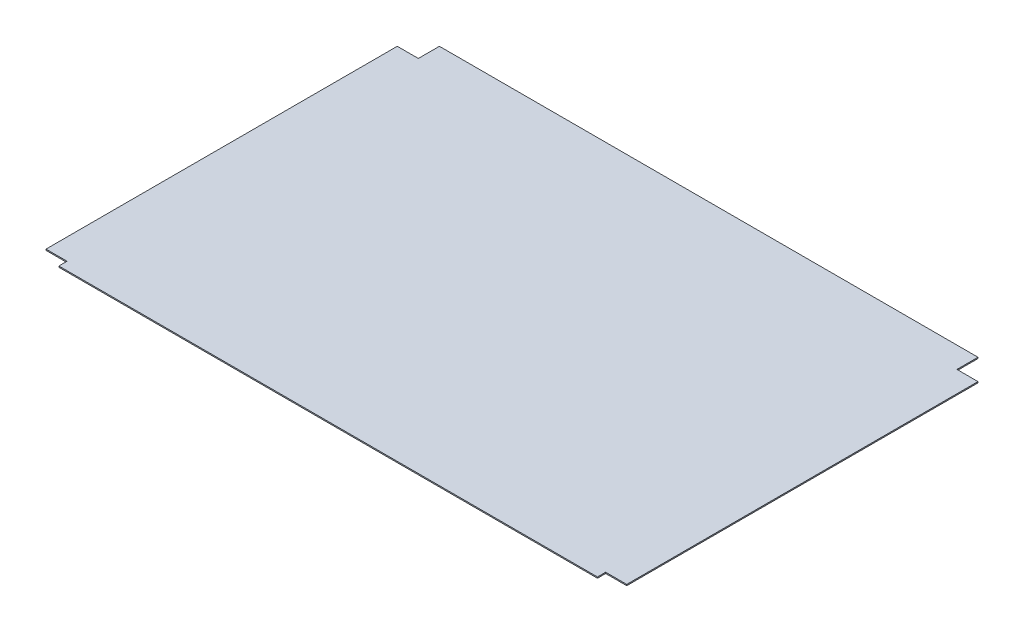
ISO-10303-21;
HEADER;
FILE_DESCRIPTION(('STEP AP214'),'2;1');
FILE_NAME('part.step','',(''),(''),'','','');
FILE_SCHEMA(('AUTOMOTIVE_DESIGN { 1 0 10303 214 1 1 1 1 }'));
ENDSEC;
DATA;
#1=APPLICATION_CONTEXT('core data for automotive mechanical design processes');
#2=APPLICATION_PROTOCOL_DEFINITION('international standard','automotive_design',2000,#1);
#3=PRODUCT_CONTEXT('',#1,'mechanical');
#4=PRODUCT('Part','Part','',(#3));
#5=PRODUCT_RELATED_PRODUCT_CATEGORY('part','',(#4));
#6=PRODUCT_DEFINITION_FORMATION('','',#4);
#7=PRODUCT_DEFINITION_CONTEXT('part definition',#1,'design');
#8=PRODUCT_DEFINITION('design','',#6,#7);
#9=PRODUCT_DEFINITION_SHAPE('','',#8);
#10=(LENGTH_UNIT() NAMED_UNIT(*) SI_UNIT(.MILLI.,.METRE.));
#11=(NAMED_UNIT(*) PLANE_ANGLE_UNIT() SI_UNIT($,.RADIAN.));
#12=(NAMED_UNIT(*) SI_UNIT($,.STERADIAN.) SOLID_ANGLE_UNIT());
#13=UNCERTAINTY_MEASURE_WITH_UNIT(LENGTH_MEASURE(1.E-05),#10,'distance_accuracy_value','');
#14=(GEOMETRIC_REPRESENTATION_CONTEXT(3) GLOBAL_UNCERTAINTY_ASSIGNED_CONTEXT((#13)) GLOBAL_UNIT_ASSIGNED_CONTEXT((#10,
#11,#12)) REPRESENTATION_CONTEXT('',''));
#15=CARTESIAN_POINT('',(0.,0.,0.));
#16=DIRECTION('',(0.,0.,1.));
#17=DIRECTION('',(1.,0.,0.));
#18=AXIS2_PLACEMENT_3D('',#15,#16,#17);
#19=CARTESIAN_POINT('',(-314.96,1.27,-213.36));
#20=DIRECTION('',(0.,1.,0.));
#21=DIRECTION('',(0.,0.,1.));
#22=AXIS2_PLACEMENT_3D('',#19,#20,#21);
#23=PLANE('',#22);
#24=DIRECTION('',(0.,0.,-1.));
#25=VECTOR('',#24,1.);
#26=CARTESIAN_POINT('',(-292.1,1.27,213.36));
#27=LINE('',#26,#25);
#28=CARTESIAN_POINT('',(-292.1,1.27,199.39));
#29=VERTEX_POINT('',#28);
#30=CARTESIAN_POINT('',(-292.1,1.27,190.5));
#31=VERTEX_POINT('',#30);
#32=EDGE_CURVE('E137',#29,#31,#27,.T.);
#33=ORIENTED_EDGE('',*,*,#32,.F.);
#34=DIRECTION('',(-1.,0.,0.));
#35=VECTOR('',#34,1.);
#36=CARTESIAN_POINT('',(292.1,1.27,199.39));
#37=LINE('',#36,#35);
#38=CARTESIAN_POINT('',(292.1,1.27,199.39));
#39=VERTEX_POINT('',#38);
#40=EDGE_CURVE('E125',#39,#29,#37,.T.);
#41=ORIENTED_EDGE('',*,*,#40,.F.);
#42=DIRECTION('',(0.,0.,-1.));
#43=VECTOR('',#42,1.);
#44=CARTESIAN_POINT('',(292.1,1.27,213.36));
#45=LINE('',#44,#43);
#46=CARTESIAN_POINT('',(292.1,1.27,190.5));
#47=VERTEX_POINT('',#46);
#48=EDGE_CURVE('E134',#39,#47,#45,.T.);
#49=ORIENTED_EDGE('',*,*,#48,.T.);
#50=DIRECTION('',(1.,0.,0.));
#51=VECTOR('',#50,1.);
#52=CARTESIAN_POINT('',(314.96,1.27,190.5));
#53=LINE('',#52,#51);
#54=CARTESIAN_POINT('',(314.96,1.27,190.5));
#55=VERTEX_POINT('',#54);
#56=EDGE_CURVE('E145',#47,#55,#53,.T.);
#57=ORIENTED_EDGE('',*,*,#56,.T.);
#58=DIRECTION('',(0.,0.,-1.));
#59=VECTOR('',#58,1.);
#60=CARTESIAN_POINT('',(314.96,1.27,213.36));
#61=LINE('',#60,#59);
#62=CARTESIAN_POINT('',(314.96,1.27,-190.5));
#63=VERTEX_POINT('',#62);
#64=EDGE_CURVE('E43',#55,#63,#61,.T.);
#65=ORIENTED_EDGE('',*,*,#64,.T.);
#66=DIRECTION('',(1.,0.,0.));
#67=VECTOR('',#66,1.);
#68=CARTESIAN_POINT('',(314.96,1.27,-190.5));
#69=LINE('',#68,#67);
#70=CARTESIAN_POINT('',(292.1,1.27,-190.5));
#71=VERTEX_POINT('',#70);
#72=EDGE_CURVE('E217',#71,#63,#69,.T.);
#73=ORIENTED_EDGE('',*,*,#72,.F.);
#74=DIRECTION('',(0.,0.,1.));
#75=VECTOR('',#74,1.);
#76=CARTESIAN_POINT('',(292.1,1.27,-213.36));
#77=LINE('',#76,#75);
#78=CARTESIAN_POINT('',(292.1,1.27,-213.36));
#79=VERTEX_POINT('',#78);
#80=EDGE_CURVE('E213',#79,#71,#77,.T.);
#81=ORIENTED_EDGE('',*,*,#80,.F.);
#82=DIRECTION('',(-1.,0.,0.));
#83=VECTOR('',#82,1.);
#84=CARTESIAN_POINT('',(314.96,1.27,-213.36));
#85=LINE('',#84,#83);
#86=CARTESIAN_POINT('',(-292.1,1.27,-213.36));
#87=VERTEX_POINT('',#86);
#88=EDGE_CURVE('E11',#79,#87,#85,.T.);
#89=ORIENTED_EDGE('',*,*,#88,.T.);
#90=DIRECTION('',(0.,0.,1.));
#91=VECTOR('',#90,1.);
#92=CARTESIAN_POINT('',(-292.1,1.27,-213.36));
#93=LINE('',#92,#91);
#94=CARTESIAN_POINT('',(-292.1,1.27,-190.5));
#95=VERTEX_POINT('',#94);
#96=EDGE_CURVE('E59',#87,#95,#93,.T.);
#97=ORIENTED_EDGE('',*,*,#96,.T.);
#98=DIRECTION('',(-1.,0.,0.));
#99=VECTOR('',#98,1.);
#100=CARTESIAN_POINT('',(-314.96,1.27,-190.5));
#101=LINE('',#100,#99);
#102=CARTESIAN_POINT('',(-314.96,1.27,-190.5));
#103=VERTEX_POINT('',#102);
#104=EDGE_CURVE('E208',#95,#103,#101,.T.);
#105=ORIENTED_EDGE('',*,*,#104,.T.);
#106=DIRECTION('',(0.,0.,1.));
#107=VECTOR('',#106,1.);
#108=CARTESIAN_POINT('',(-314.96,1.27,213.36));
#109=LINE('',#108,#107);
#110=CARTESIAN_POINT('',(-314.96,1.27,190.5));
#111=VERTEX_POINT('',#110);
#112=EDGE_CURVE('E172',#103,#111,#109,.T.);
#113=ORIENTED_EDGE('',*,*,#112,.T.);
#114=DIRECTION('',(-1.,0.,0.));
#115=VECTOR('',#114,1.);
#116=CARTESIAN_POINT('',(-314.96,1.27,190.5));
#117=LINE('',#116,#115);
#118=EDGE_CURVE('E159',#31,#111,#117,.T.);
#119=ORIENTED_EDGE('',*,*,#118,.F.);
#120=EDGE_LOOP('',(#33,#41,#49,#57,#65,#73,#81,#89,#97,#105,#113,#119));
#121=FACE_BOUND('',#120,.T.);
#122=ADVANCED_FACE('F34',(#121),#23,.T.);
#123=CARTESIAN_POINT('',(-314.96,0.,-213.36));
#124=DIRECTION('',(0.,1.,0.));
#125=DIRECTION('',(0.,0.,1.));
#126=AXIS2_PLACEMENT_3D('',#123,#124,#125);
#127=PLANE('',#126);
#128=DIRECTION('',(1.,0.,0.));
#129=VECTOR('',#128,1.);
#130=CARTESIAN_POINT('',(-292.1,0.,199.39));
#131=LINE('',#130,#129);
#132=CARTESIAN_POINT('',(-292.1,0.,199.39));
#133=VERTEX_POINT('',#132);
#134=CARTESIAN_POINT('',(292.1,0.,199.39));
#135=VERTEX_POINT('',#134);
#136=EDGE_CURVE('E51',#133,#135,#131,.T.);
#137=ORIENTED_EDGE('',*,*,#136,.F.);
#138=DIRECTION('',(0.,0.,-1.));
#139=VECTOR('',#138,1.);
#140=CARTESIAN_POINT('',(-292.1,0.,213.36));
#141=LINE('',#140,#139);
#142=CARTESIAN_POINT('',(-292.1,0.,190.5));
#143=VERTEX_POINT('',#142);
#144=EDGE_CURVE('E156',#133,#143,#141,.T.);
#145=ORIENTED_EDGE('',*,*,#144,.T.);
#146=DIRECTION('',(-1.,0.,0.));
#147=VECTOR('',#146,1.);
#148=CARTESIAN_POINT('',(-314.96,0.,190.5));
#149=LINE('',#148,#147);
#150=CARTESIAN_POINT('',(-314.96,0.,190.5));
#151=VERTEX_POINT('',#150);
#152=EDGE_CURVE('E158',#143,#151,#149,.T.);
#153=ORIENTED_EDGE('',*,*,#152,.T.);
#154=DIRECTION('',(0.,0.,1.));
#155=VECTOR('',#154,1.);
#156=CARTESIAN_POINT('',(-314.96,0.,213.36));
#157=LINE('',#156,#155);
#158=CARTESIAN_POINT('',(-314.96,0.,-190.5));
#159=VERTEX_POINT('',#158);
#160=EDGE_CURVE('E169',#159,#151,#157,.T.);
#161=ORIENTED_EDGE('',*,*,#160,.F.);
#162=DIRECTION('',(-1.,0.,0.));
#163=VECTOR('',#162,1.);
#164=CARTESIAN_POINT('',(-314.96,0.,-190.5));
#165=LINE('',#164,#163);
#166=CARTESIAN_POINT('',(-292.1,0.,-190.5));
#167=VERTEX_POINT('',#166);
#168=EDGE_CURVE('E199',#167,#159,#165,.T.);
#169=ORIENTED_EDGE('',*,*,#168,.F.);
#170=DIRECTION('',(0.,0.,1.));
#171=VECTOR('',#170,1.);
#172=CARTESIAN_POINT('',(-292.1,0.,-213.36));
#173=LINE('',#172,#171);
#174=CARTESIAN_POINT('',(-292.1,0.,-213.36));
#175=VERTEX_POINT('',#174);
#176=EDGE_CURVE('E197',#175,#167,#173,.T.);
#177=ORIENTED_EDGE('',*,*,#176,.F.);
#178=DIRECTION('',(-1.,0.,0.));
#179=VECTOR('',#178,1.);
#180=CARTESIAN_POINT('',(314.96,0.,-213.36));
#181=LINE('',#180,#179);
#182=CARTESIAN_POINT('',(292.1,0.,-213.36));
#183=VERTEX_POINT('',#182);
#184=EDGE_CURVE('E38',#183,#175,#181,.T.);
#185=ORIENTED_EDGE('',*,*,#184,.F.);
#186=DIRECTION('',(0.,0.,1.));
#187=VECTOR('',#186,1.);
#188=CARTESIAN_POINT('',(292.1,0.,-213.36));
#189=LINE('',#188,#187);
#190=CARTESIAN_POINT('',(292.1,0.,-190.5));
#191=VERTEX_POINT('',#190);
#192=EDGE_CURVE('E195',#183,#191,#189,.T.);
#193=ORIENTED_EDGE('',*,*,#192,.T.);
#194=DIRECTION('',(1.,0.,0.));
#195=VECTOR('',#194,1.);
#196=CARTESIAN_POINT('',(314.96,0.,-190.5));
#197=LINE('',#196,#195);
#198=CARTESIAN_POINT('',(314.96,0.,-190.5));
#199=VERTEX_POINT('',#198);
#200=EDGE_CURVE('E216',#191,#199,#197,.T.);
#201=ORIENTED_EDGE('',*,*,#200,.T.);
#202=DIRECTION('',(0.,0.,-1.));
#203=VECTOR('',#202,1.);
#204=CARTESIAN_POINT('',(314.96,0.,213.36));
#205=LINE('',#204,#203);
#206=CARTESIAN_POINT('',(314.96,0.,190.5));
#207=VERTEX_POINT('',#206);
#208=EDGE_CURVE('E176',#207,#199,#205,.T.);
#209=ORIENTED_EDGE('',*,*,#208,.F.);
#210=DIRECTION('',(1.,0.,0.));
#211=VECTOR('',#210,1.);
#212=CARTESIAN_POINT('',(314.96,0.,190.5));
#213=LINE('',#212,#211);
#214=CARTESIAN_POINT('',(292.1,0.,190.5));
#215=VERTEX_POINT('',#214);
#216=EDGE_CURVE('E144',#215,#207,#213,.T.);
#217=ORIENTED_EDGE('',*,*,#216,.F.);
#218=DIRECTION('',(0.,0.,-1.));
#219=VECTOR('',#218,1.);
#220=CARTESIAN_POINT('',(292.1,0.,213.36));
#221=LINE('',#220,#219);
#222=EDGE_CURVE('E147',#135,#215,#221,.T.);
#223=ORIENTED_EDGE('',*,*,#222,.F.);
#224=EDGE_LOOP('',(#137,#145,#153,#161,#169,#177,#185,#193,#201,#209,#217,#223));
#225=FACE_BOUND('',#224,.T.);
#226=ADVANCED_FACE('F193',(#225),#127,.F.);
#227=CARTESIAN_POINT('',(-292.1,0.,213.36));
#228=DIRECTION('',(1.,0.,0.));
#229=DIRECTION('',(0.,0.,-1.));
#230=AXIS2_PLACEMENT_3D('',#227,#228,#229);
#231=PLANE('',#230);
#232=DIRECTION('',(0.,-1.,0.));
#233=VECTOR('',#232,1.);
#234=CARTESIAN_POINT('',(-292.1,1.27,199.39));
#235=LINE('',#234,#233);
#236=EDGE_CURVE('E138',#29,#133,#235,.T.);
#237=ORIENTED_EDGE('',*,*,#236,.F.);
#238=ORIENTED_EDGE('',*,*,#32,.T.);
#239=DIRECTION('',(0.,1.,0.));
#240=VECTOR('',#239,1.);
#241=CARTESIAN_POINT('',(-292.1,0.,190.5));
#242=LINE('',#241,#240);
#243=EDGE_CURVE('E162',#143,#31,#242,.T.);
#244=ORIENTED_EDGE('',*,*,#243,.F.);
#245=ORIENTED_EDGE('',*,*,#144,.F.);
#246=EDGE_LOOP('',(#237,#238,#244,#245));
#247=FACE_BOUND('',#246,.T.);
#248=ADVANCED_FACE('F253',(#247),#231,.F.);
#249=CARTESIAN_POINT('',(292.1,0.,213.36));
#250=DIRECTION('',(1.,0.,0.));
#251=DIRECTION('',(0.,0.,-1.));
#252=AXIS2_PLACEMENT_3D('',#249,#250,#251);
#253=PLANE('',#252);
#254=ORIENTED_EDGE('',*,*,#48,.F.);
#255=DIRECTION('',(0.,1.,0.));
#256=VECTOR('',#255,1.);
#257=CARTESIAN_POINT('',(292.1,0.,199.39));
#258=LINE('',#257,#256);
#259=EDGE_CURVE('E122',#135,#39,#258,.T.);
#260=ORIENTED_EDGE('',*,*,#259,.F.);
#261=ORIENTED_EDGE('',*,*,#222,.T.);
#262=DIRECTION('',(0.,1.,0.));
#263=VECTOR('',#262,1.);
#264=CARTESIAN_POINT('',(292.1,0.,190.5));
#265=LINE('',#264,#263);
#266=EDGE_CURVE('E142',#215,#47,#265,.T.);
#267=ORIENTED_EDGE('',*,*,#266,.T.);
#268=EDGE_LOOP('',(#254,#260,#261,#267));
#269=FACE_BOUND('',#268,.T.);
#270=ADVANCED_FACE('F140',(#269),#253,.T.);
#271=CARTESIAN_POINT('',(-314.96,1.27,213.36));
#272=DIRECTION('',(1.,0.,0.));
#273=DIRECTION('',(0.,0.,-1.));
#274=AXIS2_PLACEMENT_3D('',#271,#272,#273);
#275=PLANE('',#274);
#276=DIRECTION('',(0.,1.,0.));
#277=VECTOR('',#276,1.);
#278=CARTESIAN_POINT('',(-314.96,0.,-190.5));
#279=LINE('',#278,#277);
#280=EDGE_CURVE('E201',#159,#103,#279,.T.);
#281=ORIENTED_EDGE('',*,*,#280,.F.);
#282=ORIENTED_EDGE('',*,*,#160,.T.);
#283=DIRECTION('',(0.,1.,0.));
#284=VECTOR('',#283,1.);
#285=CARTESIAN_POINT('',(-314.96,0.,190.5));
#286=LINE('',#285,#284);
#287=EDGE_CURVE('E166',#151,#111,#286,.T.);
#288=ORIENTED_EDGE('',*,*,#287,.T.);
#289=ORIENTED_EDGE('',*,*,#112,.F.);
#290=EDGE_LOOP('',(#281,#282,#288,#289));
#291=FACE_BOUND('',#290,.T.);
#292=ADVANCED_FACE('F36',(#291),#275,.F.);
#293=CARTESIAN_POINT('',(314.96,1.27,-213.36));
#294=DIRECTION('',(0.,0.,1.));
#295=DIRECTION('',(1.,0.,0.));
#296=AXIS2_PLACEMENT_3D('',#293,#294,#295);
#297=PLANE('',#296);
#298=DIRECTION('',(0.,1.,0.));
#299=VECTOR('',#298,1.);
#300=CARTESIAN_POINT('',(-292.1,0.,-213.36));
#301=LINE('',#300,#299);
#302=EDGE_CURVE('E188',#175,#87,#301,.T.);
#303=ORIENTED_EDGE('',*,*,#302,.T.);
#304=ORIENTED_EDGE('',*,*,#88,.F.);
#305=DIRECTION('',(0.,1.,0.));
#306=VECTOR('',#305,1.);
#307=CARTESIAN_POINT('',(292.1,0.,-213.36));
#308=LINE('',#307,#306);
#309=EDGE_CURVE('E189',#183,#79,#308,.T.);
#310=ORIENTED_EDGE('',*,*,#309,.F.);
#311=ORIENTED_EDGE('',*,*,#184,.T.);
#312=EDGE_LOOP('',(#303,#304,#310,#311));
#313=FACE_BOUND('',#312,.T.);
#314=ADVANCED_FACE('F186',(#313),#297,.F.);
#315=CARTESIAN_POINT('',(314.96,1.27,213.36));
#316=DIRECTION('',(-1.,0.,0.));
#317=DIRECTION('',(0.,0.,1.));
#318=AXIS2_PLACEMENT_3D('',#315,#316,#317);
#319=PLANE('',#318);
#320=ORIENTED_EDGE('',*,*,#208,.T.);
#321=DIRECTION('',(0.,1.,0.));
#322=VECTOR('',#321,1.);
#323=CARTESIAN_POINT('',(314.96,0.,-190.5));
#324=LINE('',#323,#322);
#325=EDGE_CURVE('E149',#199,#63,#324,.T.);
#326=ORIENTED_EDGE('',*,*,#325,.T.);
#327=ORIENTED_EDGE('',*,*,#64,.F.);
#328=DIRECTION('',(0.,1.,0.));
#329=VECTOR('',#328,1.);
#330=CARTESIAN_POINT('',(314.96,0.,190.5));
#331=LINE('',#330,#329);
#332=EDGE_CURVE('E154',#207,#55,#331,.T.);
#333=ORIENTED_EDGE('',*,*,#332,.F.);
#334=EDGE_LOOP('',(#320,#326,#327,#333));
#335=FACE_BOUND('',#334,.T.);
#336=ADVANCED_FACE('F233',(#335),#319,.F.);
#337=CARTESIAN_POINT('',(-314.96,0.,190.5));
#338=DIRECTION('',(0.,0.,-1.));
#339=DIRECTION('',(-1.,0.,0.));
#340=AXIS2_PLACEMENT_3D('',#337,#338,#339);
#341=PLANE('',#340);
#342=ORIENTED_EDGE('',*,*,#118,.T.);
#343=ORIENTED_EDGE('',*,*,#287,.F.);
#344=ORIENTED_EDGE('',*,*,#152,.F.);
#345=ORIENTED_EDGE('',*,*,#243,.T.);
#346=EDGE_LOOP('',(#342,#343,#344,#345));
#347=FACE_BOUND('',#346,.T.);
#348=ADVANCED_FACE('F260',(#347),#341,.F.);
#349=CARTESIAN_POINT('',(314.96,0.,190.5));
#350=DIRECTION('',(0.,0.,1.));
#351=DIRECTION('',(1.,0.,0.));
#352=AXIS2_PLACEMENT_3D('',#349,#350,#351);
#353=PLANE('',#352);
#354=ORIENTED_EDGE('',*,*,#56,.F.);
#355=ORIENTED_EDGE('',*,*,#266,.F.);
#356=ORIENTED_EDGE('',*,*,#216,.T.);
#357=ORIENTED_EDGE('',*,*,#332,.T.);
#358=EDGE_LOOP('',(#354,#355,#356,#357));
#359=FACE_BOUND('',#358,.T.);
#360=ADVANCED_FACE('F227',(#359),#353,.T.);
#361=CARTESIAN_POINT('',(314.96,0.,-190.5));
#362=DIRECTION('',(0.,0.,1.));
#363=DIRECTION('',(1.,0.,0.));
#364=AXIS2_PLACEMENT_3D('',#361,#362,#363);
#365=PLANE('',#364);
#366=ORIENTED_EDGE('',*,*,#72,.T.);
#367=ORIENTED_EDGE('',*,*,#325,.F.);
#368=ORIENTED_EDGE('',*,*,#200,.F.);
#369=DIRECTION('',(0.,1.,0.));
#370=VECTOR('',#369,1.);
#371=CARTESIAN_POINT('',(292.1,0.,-190.5));
#372=LINE('',#371,#370);
#373=EDGE_CURVE('E223',#191,#71,#372,.T.);
#374=ORIENTED_EDGE('',*,*,#373,.T.);
#375=EDGE_LOOP('',(#366,#367,#368,#374));
#376=FACE_BOUND('',#375,.T.);
#377=ADVANCED_FACE('F230',(#376),#365,.F.);
#378=CARTESIAN_POINT('',(292.1,0.,-213.36));
#379=DIRECTION('',(-1.,0.,0.));
#380=DIRECTION('',(0.,0.,1.));
#381=AXIS2_PLACEMENT_3D('',#378,#379,#380);
#382=PLANE('',#381);
#383=ORIENTED_EDGE('',*,*,#80,.T.);
#384=ORIENTED_EDGE('',*,*,#373,.F.);
#385=ORIENTED_EDGE('',*,*,#192,.F.);
#386=ORIENTED_EDGE('',*,*,#309,.T.);
#387=EDGE_LOOP('',(#383,#384,#385,#386));
#388=FACE_BOUND('',#387,.T.);
#389=ADVANCED_FACE('F236',(#388),#382,.F.);
#390=CARTESIAN_POINT('',(-292.1,0.,-213.36));
#391=DIRECTION('',(-1.,0.,0.));
#392=DIRECTION('',(0.,0.,1.));
#393=AXIS2_PLACEMENT_3D('',#390,#391,#392);
#394=PLANE('',#393);
#395=ORIENTED_EDGE('',*,*,#96,.F.);
#396=ORIENTED_EDGE('',*,*,#302,.F.);
#397=ORIENTED_EDGE('',*,*,#176,.T.);
#398=DIRECTION('',(0.,1.,0.));
#399=VECTOR('',#398,1.);
#400=CARTESIAN_POINT('',(-292.1,0.,-190.5));
#401=LINE('',#400,#399);
#402=EDGE_CURVE('E203',#167,#95,#401,.T.);
#403=ORIENTED_EDGE('',*,*,#402,.T.);
#404=EDGE_LOOP('',(#395,#396,#397,#403));
#405=FACE_BOUND('',#404,.T.);
#406=ADVANCED_FACE('F238',(#405),#394,.T.);
#407=CARTESIAN_POINT('',(-314.96,0.,-190.5));
#408=DIRECTION('',(0.,0.,-1.));
#409=DIRECTION('',(-1.,0.,0.));
#410=AXIS2_PLACEMENT_3D('',#407,#408,#409);
#411=PLANE('',#410);
#412=ORIENTED_EDGE('',*,*,#104,.F.);
#413=ORIENTED_EDGE('',*,*,#402,.F.);
#414=ORIENTED_EDGE('',*,*,#168,.T.);
#415=ORIENTED_EDGE('',*,*,#280,.T.);
#416=EDGE_LOOP('',(#412,#413,#414,#415));
#417=FACE_BOUND('',#416,.T.);
#418=ADVANCED_FACE('F244',(#417),#411,.T.);
#419=CARTESIAN_POINT('',(292.1,0.,199.39));
#420=DIRECTION('',(0.,0.,1.));
#421=DIRECTION('',(1.,0.,0.));
#422=AXIS2_PLACEMENT_3D('',#419,#420,#421);
#423=PLANE('',#422);
#424=ORIENTED_EDGE('',*,*,#136,.T.);
#425=ORIENTED_EDGE('',*,*,#259,.T.);
#426=ORIENTED_EDGE('',*,*,#40,.T.);
#427=ORIENTED_EDGE('',*,*,#236,.T.);
#428=EDGE_LOOP('',(#424,#425,#426,#427));
#429=FACE_BOUND('',#428,.T.);
#430=ADVANCED_FACE('F124',(#429),#423,.T.);
#431=CLOSED_SHELL('',(#122,#226,#248,#270,#292,#314,#336,#348,#360,#377,#389,#406,#418,#430));
#432=MANIFOLD_SOLID_BREP('B2',#431);
#433=ADVANCED_BREP_SHAPE_REPRESENTATION('',(#18,#432),#14);
#434=SHAPE_DEFINITION_REPRESENTATION(#9,#433);
ENDSEC;
END-ISO-10303-21;
